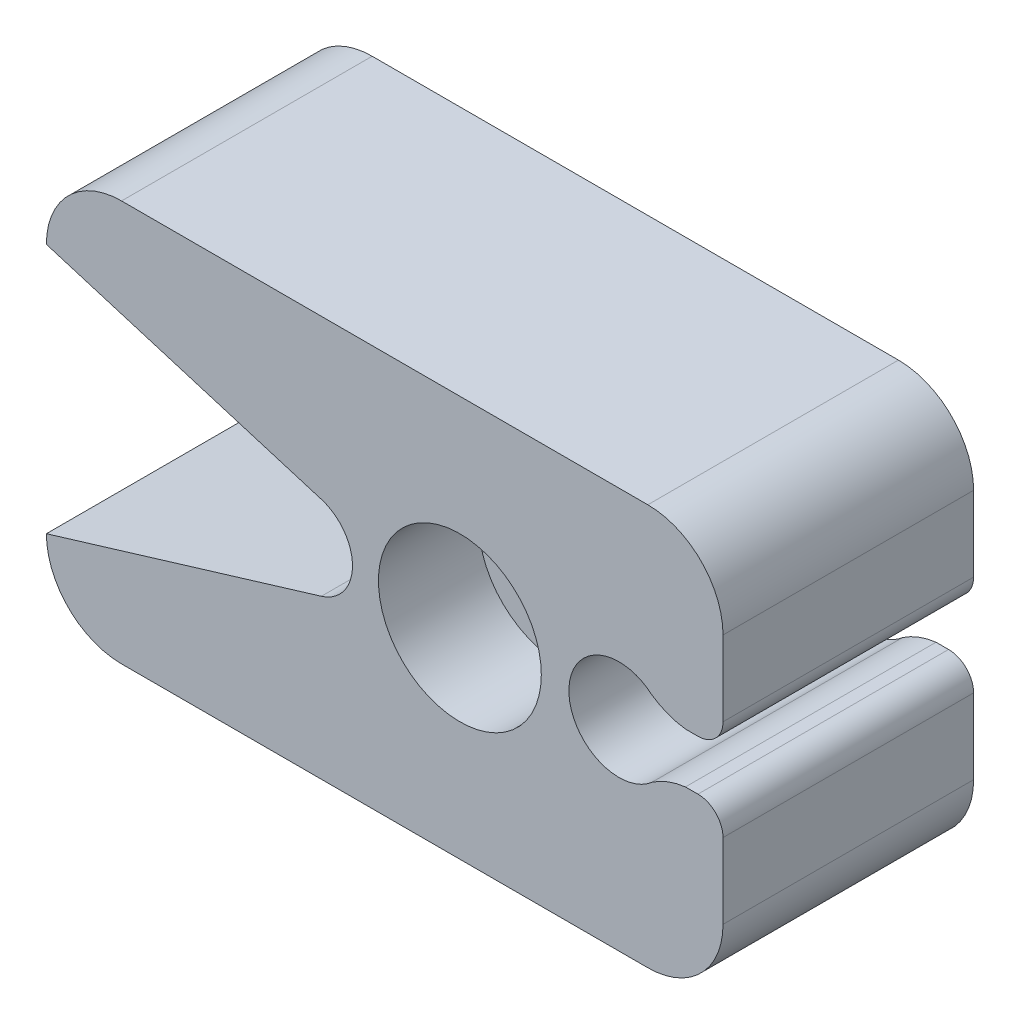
ISO-10303-21;
HEADER;
FILE_DESCRIPTION(('STEP AP214'),'2;1');
FILE_NAME('part.step','',(''),(''),'','','');
FILE_SCHEMA(('AUTOMOTIVE_DESIGN { 1 0 10303 214 1 1 1 1 }'));
ENDSEC;
DATA;
#1=APPLICATION_CONTEXT('core data for automotive mechanical design processes');
#2=APPLICATION_PROTOCOL_DEFINITION('international standard','automotive_design',2000,#1);
#3=PRODUCT_CONTEXT('',#1,'mechanical');
#4=PRODUCT('Part','Part','',(#3));
#5=PRODUCT_RELATED_PRODUCT_CATEGORY('part','',(#4));
#6=PRODUCT_DEFINITION_FORMATION('','',#4);
#7=PRODUCT_DEFINITION_CONTEXT('part definition',#1,'design');
#8=PRODUCT_DEFINITION('design','',#6,#7);
#9=PRODUCT_DEFINITION_SHAPE('','',#8);
#10=(LENGTH_UNIT() NAMED_UNIT(*) SI_UNIT(.MILLI.,.METRE.));
#11=(NAMED_UNIT(*) PLANE_ANGLE_UNIT() SI_UNIT($,.RADIAN.));
#12=(NAMED_UNIT(*) SI_UNIT($,.STERADIAN.) SOLID_ANGLE_UNIT());
#13=UNCERTAINTY_MEASURE_WITH_UNIT(LENGTH_MEASURE(1.E-05),#10,'distance_accuracy_value','');
#14=(GEOMETRIC_REPRESENTATION_CONTEXT(3) GLOBAL_UNCERTAINTY_ASSIGNED_CONTEXT((#13)) GLOBAL_UNIT_ASSIGNED_CONTEXT((#10,
#11,#12)) REPRESENTATION_CONTEXT('',''));
#15=CARTESIAN_POINT('',(0.,0.,0.));
#16=DIRECTION('',(0.,0.,1.));
#17=DIRECTION('',(1.,0.,0.));
#18=AXIS2_PLACEMENT_3D('',#15,#16,#17);
#19=CARTESIAN_POINT('',(21.,32.,20.));
#20=DIRECTION('',(-1.,0.,0.));
#21=DIRECTION('',(0.,-1.,0.));
#22=AXIS2_PLACEMENT_3D('',#19,#20,#21);
#23=PLANE('',#22);
#24=DIRECTION('',(0.,1.,0.));
#25=VECTOR('',#24,1.);
#26=CARTESIAN_POINT('',(21.,32.,20.));
#27=LINE('',#26,#25);
#28=CARTESIAN_POINT('',(21.,20.,20.));
#29=VERTEX_POINT('',#28);
#30=CARTESIAN_POINT('',(21.,26.,20.));
#31=VERTEX_POINT('',#30);
#32=EDGE_CURVE('E199',#29,#31,#27,.T.);
#33=ORIENTED_EDGE('',*,*,#32,.F.);
#34=DIRECTION('',(0.,0.,-1.));
#35=VECTOR('',#34,1.);
#36=CARTESIAN_POINT('',(21.,20.,0.));
#37=LINE('',#36,#35);
#38=CARTESIAN_POINT('',(21.,20.,0.));
#39=VERTEX_POINT('',#38);
#40=EDGE_CURVE('E24',#29,#39,#37,.T.);
#41=ORIENTED_EDGE('',*,*,#40,.T.);
#42=DIRECTION('',(0.,1.,0.));
#43=VECTOR('',#42,1.);
#44=CARTESIAN_POINT('',(21.,32.,0.));
#45=LINE('',#44,#43);
#46=CARTESIAN_POINT('',(21.,26.,0.));
#47=VERTEX_POINT('',#46);
#48=EDGE_CURVE('E194',#39,#47,#45,.T.);
#49=ORIENTED_EDGE('',*,*,#48,.T.);
#50=DIRECTION('',(0.,0.,-1.));
#51=VECTOR('',#50,1.);
#52=CARTESIAN_POINT('',(21.,26.,20.));
#53=LINE('',#52,#51);
#54=EDGE_CURVE('E232',#47,#31,#53,.F.);
#55=ORIENTED_EDGE('',*,*,#54,.T.);
#56=EDGE_LOOP('',(#33,#41,#49,#55));
#57=FACE_BOUND('',#56,.T.);
#58=ADVANCED_FACE('F16',(#57),#23,.F.);
#59=CARTESIAN_POINT('',(21.,6.,0.));
#60=VERTEX_POINT('',#59);
#61=CARTESIAN_POINT('',(21.,12.,0.));
#62=VERTEX_POINT('',#61);
#63=EDGE_CURVE('E207',#60,#62,#45,.T.);
#64=ORIENTED_EDGE('',*,*,#63,.T.);
#65=DIRECTION('',(0.,0.,-1.));
#66=VECTOR('',#65,1.);
#67=CARTESIAN_POINT('',(21.,12.,20.));
#68=LINE('',#67,#66);
#69=CARTESIAN_POINT('',(21.,12.,20.));
#70=VERTEX_POINT('',#69);
#71=EDGE_CURVE('E272',#62,#70,#68,.F.);
#72=ORIENTED_EDGE('',*,*,#71,.T.);
#73=CARTESIAN_POINT('',(21.,6.,20.));
#74=VERTEX_POINT('',#73);
#75=EDGE_CURVE('E201',#74,#70,#27,.T.);
#76=ORIENTED_EDGE('',*,*,#75,.F.);
#77=DIRECTION('',(0.,0.,-1.));
#78=VECTOR('',#77,1.);
#79=CARTESIAN_POINT('',(21.,6.,20.));
#80=LINE('',#79,#78);
#81=EDGE_CURVE('E229',#74,#60,#80,.T.);
#82=ORIENTED_EDGE('',*,*,#81,.T.);
#83=EDGE_LOOP('',(#64,#72,#76,#82));
#84=FACE_BOUND('',#83,.T.);
#85=ADVANCED_FACE('F326',(#84),#23,.F.);
#86=CARTESIAN_POINT('',(0.,0.,20.));
#87=DIRECTION('',(0.,0.,-1.));
#88=DIRECTION('',(-1.,0.,0.));
#89=AXIS2_PLACEMENT_3D('',#86,#87,#88);
#90=PLANE('',#89);
#91=CARTESIAN_POINT('',(0.,16.,20.));
#92=DIRECTION('',(0.,0.,1.));
#93=DIRECTION('',(1.,0.,0.));
#94=AXIS2_PLACEMENT_3D('',#91,#92,#93);
#95=CIRCLE('',#94,6.5);
#96=CARTESIAN_POINT('',(6.5,16.,20.));
#97=VERTEX_POINT('',#96);
#98=EDGE_CURVE('E343',#97,#97,#95,.T.);
#99=ORIENTED_EDGE('',*,*,#98,.F.);
#100=EDGE_LOOP('',(#99));
#101=FACE_BOUND('',#100,.T.);
#102=ORIENTED_EDGE('',*,*,#75,.T.);
#103=CARTESIAN_POINT('',(19.,12.,20.));
#104=DIRECTION('',(0.,0.,-1.));
#105=DIRECTION('',(-1.,0.,0.));
#106=AXIS2_PLACEMENT_3D('',#103,#104,#105);
#107=CIRCLE('',#106,2.);
#108=CARTESIAN_POINT('',(19.,14.,20.));
#109=VERTEX_POINT('',#108);
#110=EDGE_CURVE('E275',#70,#109,#107,.F.);
#111=ORIENTED_EDGE('',*,*,#110,.T.);
#112=DIRECTION('',(1.,0.,0.));
#113=VECTOR('',#112,1.);
#114=CARTESIAN_POINT('',(18.,14.,20.));
#115=LINE('',#114,#113);
#116=CARTESIAN_POINT('',(18.,14.,20.));
#117=VERTEX_POINT('',#116);
#118=EDGE_CURVE('E162',#117,#109,#115,.T.);
#119=ORIENTED_EDGE('',*,*,#118,.F.);
#120=CARTESIAN_POINT('',(18.7331691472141,8.04496322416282,20.));
#121=DIRECTION('',(0.,0.,-1.));
#122=DIRECTION('',(-1.,0.,0.));
#123=AXIS2_PLACEMENT_3D('',#120,#121,#122);
#124=CIRCLE('',#123,6.);
#125=CARTESIAN_POINT('',(15.3315337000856,12.9875208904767,20.));
#126=VERTEX_POINT('',#125);
#127=EDGE_CURVE('E172',#126,#117,#124,.T.);
#128=ORIENTED_EDGE('',*,*,#127,.F.);
#129=CARTESIAN_POINT('',(12.7,16.,20.));
#130=DIRECTION('',(0.,0.,1.));
#131=DIRECTION('',(1.,0.,0.));
#132=AXIS2_PLACEMENT_3D('',#129,#130,#131);
#133=CIRCLE('',#132,4.);
#134=CARTESIAN_POINT('',(15.3315337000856,19.0124791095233,20.));
#135=VERTEX_POINT('',#134);
#136=EDGE_CURVE('E154',#135,#126,#133,.T.);
#137=ORIENTED_EDGE('',*,*,#136,.F.);
#138=CARTESIAN_POINT('',(18.7331691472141,23.9550367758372,20.));
#139=DIRECTION('',(0.,0.,-1.));
#140=DIRECTION('',(1.,0.,0.));
#141=AXIS2_PLACEMENT_3D('',#138,#139,#140);
#142=CIRCLE('',#141,6.);
#143=CARTESIAN_POINT('',(18.,18.,20.));
#144=VERTEX_POINT('',#143);
#145=EDGE_CURVE('E144',#144,#135,#142,.T.);
#146=ORIENTED_EDGE('',*,*,#145,.F.);
#147=DIRECTION('',(-1.,0.,0.));
#148=VECTOR('',#147,1.);
#149=CARTESIAN_POINT('',(18.,18.,20.));
#150=LINE('',#149,#148);
#151=CARTESIAN_POINT('',(19.,18.,20.));
#152=VERTEX_POINT('',#151);
#153=EDGE_CURVE('E138',#152,#144,#150,.T.);
#154=ORIENTED_EDGE('',*,*,#153,.F.);
#155=CARTESIAN_POINT('',(19.,20.,20.));
#156=DIRECTION('',(0.,0.,-1.));
#157=DIRECTION('',(-1.,0.,0.));
#158=AXIS2_PLACEMENT_3D('',#155,#156,#157);
#159=CIRCLE('',#158,2.);
#160=EDGE_CURVE('E31',#152,#29,#159,.F.);
#161=ORIENTED_EDGE('',*,*,#160,.T.);
#162=ORIENTED_EDGE('',*,*,#32,.T.);
#163=CARTESIAN_POINT('',(15.,26.,20.));
#164=DIRECTION('',(0.,0.,-1.));
#165=DIRECTION('',(-1.,0.,0.));
#166=AXIS2_PLACEMENT_3D('',#163,#164,#165);
#167=CIRCLE('',#166,6.);
#168=CARTESIAN_POINT('',(15.,32.,20.));
#169=VERTEX_POINT('',#168);
#170=EDGE_CURVE('E242',#31,#169,#167,.F.);
#171=ORIENTED_EDGE('',*,*,#170,.T.);
#172=DIRECTION('',(-1.,0.,0.));
#173=VECTOR('',#172,1.);
#174=CARTESIAN_POINT('',(-33.,32.,20.));
#175=LINE('',#174,#173);
#176=CARTESIAN_POINT('',(-27.,32.,20.));
#177=VERTEX_POINT('',#176);
#178=EDGE_CURVE('E203',#169,#177,#175,.T.);
#179=ORIENTED_EDGE('',*,*,#178,.T.);
#180=CARTESIAN_POINT('',(-27.,26.,20.));
#181=DIRECTION('',(0.,0.,-1.));
#182=DIRECTION('',(-1.,0.,0.));
#183=AXIS2_PLACEMENT_3D('',#180,#181,#182);
#184=CIRCLE('',#183,6.);
#185=CARTESIAN_POINT('',(-33.,26.,20.));
#186=VERTEX_POINT('',#185);
#187=EDGE_CURVE('E235',#177,#186,#184,.F.);
#188=ORIENTED_EDGE('',*,*,#187,.T.);
#189=DIRECTION('',(-0.957024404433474,0.290007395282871,0.));
#190=VECTOR('',#189,1.);
#191=CARTESIAN_POINT('',(-33.,26.,20.));
#192=LINE('',#191,#190);
#193=CARTESIAN_POINT('',(-11.0536318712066,19.3495854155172,20.));
#194=VERTEX_POINT('',#193);
#195=EDGE_CURVE('E179',#194,#186,#192,.T.);
#196=ORIENTED_EDGE('',*,*,#195,.F.);
#197=CARTESIAN_POINT('',(-12.0686577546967,16.,20.));
#198=DIRECTION('',(0.,0.,1.));
#199=DIRECTION('',(1.,0.,0.));
#200=AXIS2_PLACEMENT_3D('',#197,#198,#199);
#201=CIRCLE('',#200,3.5);
#202=CARTESIAN_POINT('',(-11.0536318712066,12.6504145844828,20.));
#203=VERTEX_POINT('',#202);
#204=EDGE_CURVE('E188',#203,#194,#201,.T.);
#205=ORIENTED_EDGE('',*,*,#204,.F.);
#206=DIRECTION('',(0.957024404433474,0.290007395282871,0.));
#207=VECTOR('',#206,1.);
#208=CARTESIAN_POINT('',(-33.,6.,20.));
#209=LINE('',#208,#207);
#210=CARTESIAN_POINT('',(-33.,6.,20.));
#211=VERTEX_POINT('',#210);
#212=EDGE_CURVE('E143',#211,#203,#209,.T.);
#213=ORIENTED_EDGE('',*,*,#212,.F.);
#214=CARTESIAN_POINT('',(-27.,6.,20.));
#215=DIRECTION('',(0.,0.,-1.));
#216=DIRECTION('',(-1.,0.,0.));
#217=AXIS2_PLACEMENT_3D('',#214,#215,#216);
#218=CIRCLE('',#217,6.);
#219=CARTESIAN_POINT('',(-27.,0.,20.));
#220=VERTEX_POINT('',#219);
#221=EDGE_CURVE('E238',#211,#220,#218,.F.);
#222=ORIENTED_EDGE('',*,*,#221,.T.);
#223=DIRECTION('',(1.,0.,0.));
#224=VECTOR('',#223,1.);
#225=CARTESIAN_POINT('',(21.,0.,20.));
#226=LINE('',#225,#224);
#227=CARTESIAN_POINT('',(15.,0.,20.));
#228=VERTEX_POINT('',#227);
#229=EDGE_CURVE('E196',#220,#228,#226,.T.);
#230=ORIENTED_EDGE('',*,*,#229,.T.);
#231=CARTESIAN_POINT('',(15.,6.,20.));
#232=DIRECTION('',(0.,0.,-1.));
#233=DIRECTION('',(-1.,0.,0.));
#234=AXIS2_PLACEMENT_3D('',#231,#232,#233);
#235=CIRCLE('',#234,6.);
#236=EDGE_CURVE('E240',#228,#74,#235,.F.);
#237=ORIENTED_EDGE('',*,*,#236,.T.);
#238=EDGE_LOOP('',(#102,#111,#119,#128,#137,#146,#154,#161,#162,#171,#179,#188,#196,#205,#213,
#222,#230,#237));
#239=FACE_BOUND('',#238,.T.);
#240=ADVANCED_FACE('F157',(#101,#239),#90,.F.);
#241=CARTESIAN_POINT('',(0.,0.,0.));
#242=DIRECTION('',(0.,0.,-1.));
#243=DIRECTION('',(-1.,0.,0.));
#244=AXIS2_PLACEMENT_3D('',#241,#242,#243);
#245=PLANE('',#244);
#246=CARTESIAN_POINT('',(0.,16.,0.));
#247=DIRECTION('',(0.,0.,1.));
#248=DIRECTION('',(1.,0.,0.));
#249=AXIS2_PLACEMENT_3D('',#246,#247,#248);
#250=CIRCLE('',#249,4.);
#251=CARTESIAN_POINT('',(4.,16.,0.));
#252=VERTEX_POINT('',#251);
#253=EDGE_CURVE('E346',#252,#252,#250,.T.);
#254=ORIENTED_EDGE('',*,*,#253,.T.);
#255=EDGE_LOOP('',(#254));
#256=FACE_BOUND('',#255,.T.);
#257=DIRECTION('',(1.,0.,0.));
#258=VECTOR('',#257,1.);
#259=CARTESIAN_POINT('',(0.,14.,0.));
#260=LINE('',#259,#258);
#261=CARTESIAN_POINT('',(18.,14.,0.));
#262=VERTEX_POINT('',#261);
#263=CARTESIAN_POINT('',(19.,14.,0.));
#264=VERTEX_POINT('',#263);
#265=EDGE_CURVE('E253',#262,#264,#260,.T.);
#266=ORIENTED_EDGE('',*,*,#265,.T.);
#267=CARTESIAN_POINT('',(19.,12.,0.));
#268=DIRECTION('',(0.,0.,-1.));
#269=DIRECTION('',(-1.,0.,0.));
#270=AXIS2_PLACEMENT_3D('',#267,#268,#269);
#271=CIRCLE('',#270,2.);
#272=EDGE_CURVE('E270',#264,#62,#271,.T.);
#273=ORIENTED_EDGE('',*,*,#272,.T.);
#274=ORIENTED_EDGE('',*,*,#63,.F.);
#275=CARTESIAN_POINT('',(15.,6.,0.));
#276=DIRECTION('',(0.,0.,-1.));
#277=DIRECTION('',(-1.,0.,0.));
#278=AXIS2_PLACEMENT_3D('',#275,#276,#277);
#279=CIRCLE('',#278,6.);
#280=CARTESIAN_POINT('',(15.,0.,0.));
#281=VERTEX_POINT('',#280);
#282=EDGE_CURVE('E224',#60,#281,#279,.T.);
#283=ORIENTED_EDGE('',*,*,#282,.T.);
#284=DIRECTION('',(1.,0.,0.));
#285=VECTOR('',#284,1.);
#286=CARTESIAN_POINT('',(0.,0.,0.));
#287=LINE('',#286,#285);
#288=CARTESIAN_POINT('',(-27.,0.,0.));
#289=VERTEX_POINT('',#288);
#290=EDGE_CURVE('E200',#289,#281,#287,.T.);
#291=ORIENTED_EDGE('',*,*,#290,.F.);
#292=CARTESIAN_POINT('',(-27.,6.,0.));
#293=DIRECTION('',(0.,0.,-1.));
#294=DIRECTION('',(-1.,0.,0.));
#295=AXIS2_PLACEMENT_3D('',#292,#293,#294);
#296=CIRCLE('',#295,6.);
#297=CARTESIAN_POINT('',(-33.,6.,0.));
#298=VERTEX_POINT('',#297);
#299=EDGE_CURVE('E221',#289,#298,#296,.T.);
#300=ORIENTED_EDGE('',*,*,#299,.T.);
#301=DIRECTION('',(0.957024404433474,0.290007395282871,0.));
#302=VECTOR('',#301,1.);
#303=CARTESIAN_POINT('',(-33.,6.,0.));
#304=LINE('',#303,#302);
#305=CARTESIAN_POINT('',(-11.0536318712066,12.6504145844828,0.));
#306=VERTEX_POINT('',#305);
#307=EDGE_CURVE('E175',#298,#306,#304,.T.);
#308=ORIENTED_EDGE('',*,*,#307,.T.);
#309=CARTESIAN_POINT('',(-12.0686577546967,16.,0.));
#310=DIRECTION('',(0.,0.,1.));
#311=DIRECTION('',(1.,0.,0.));
#312=AXIS2_PLACEMENT_3D('',#309,#310,#311);
#313=CIRCLE('',#312,3.5);
#314=CARTESIAN_POINT('',(-11.0536318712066,19.3495854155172,0.));
#315=VERTEX_POINT('',#314);
#316=EDGE_CURVE('E178',#306,#315,#313,.T.);
#317=ORIENTED_EDGE('',*,*,#316,.T.);
#318=DIRECTION('',(-0.957024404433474,0.290007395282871,0.));
#319=VECTOR('',#318,1.);
#320=CARTESIAN_POINT('',(-33.,26.,0.));
#321=LINE('',#320,#319);
#322=CARTESIAN_POINT('',(-33.,26.,0.));
#323=VERTEX_POINT('',#322);
#324=EDGE_CURVE('E182',#315,#323,#321,.T.);
#325=ORIENTED_EDGE('',*,*,#324,.T.);
#326=CARTESIAN_POINT('',(-27.,26.,0.));
#327=DIRECTION('',(0.,0.,-1.));
#328=DIRECTION('',(-1.,0.,0.));
#329=AXIS2_PLACEMENT_3D('',#326,#327,#328);
#330=CIRCLE('',#329,6.);
#331=CARTESIAN_POINT('',(-27.,32.,0.));
#332=VERTEX_POINT('',#331);
#333=EDGE_CURVE('E219',#323,#332,#330,.T.);
#334=ORIENTED_EDGE('',*,*,#333,.T.);
#335=DIRECTION('',(-1.,0.,0.));
#336=VECTOR('',#335,1.);
#337=CARTESIAN_POINT('',(-33.,32.,0.));
#338=LINE('',#337,#336);
#339=CARTESIAN_POINT('',(15.,32.,0.));
#340=VERTEX_POINT('',#339);
#341=EDGE_CURVE('E210',#340,#332,#338,.T.);
#342=ORIENTED_EDGE('',*,*,#341,.F.);
#343=CARTESIAN_POINT('',(15.,26.,0.));
#344=DIRECTION('',(0.,0.,-1.));
#345=DIRECTION('',(-1.,0.,0.));
#346=AXIS2_PLACEMENT_3D('',#343,#344,#345);
#347=CIRCLE('',#346,6.);
#348=EDGE_CURVE('E226',#340,#47,#347,.T.);
#349=ORIENTED_EDGE('',*,*,#348,.T.);
#350=ORIENTED_EDGE('',*,*,#48,.F.);
#351=CARTESIAN_POINT('',(19.,20.,0.));
#352=DIRECTION('',(0.,0.,-1.));
#353=DIRECTION('',(-1.,0.,0.));
#354=AXIS2_PLACEMENT_3D('',#351,#352,#353);
#355=CIRCLE('',#354,2.);
#356=CARTESIAN_POINT('',(19.,18.,0.));
#357=VERTEX_POINT('',#356);
#358=EDGE_CURVE('E268',#39,#357,#355,.T.);
#359=ORIENTED_EDGE('',*,*,#358,.T.);
#360=DIRECTION('',(-1.,0.,0.));
#361=VECTOR('',#360,1.);
#362=CARTESIAN_POINT('',(0.,18.,0.));
#363=LINE('',#362,#361);
#364=CARTESIAN_POINT('',(18.,18.,0.));
#365=VERTEX_POINT('',#364);
#366=EDGE_CURVE('E263',#357,#365,#363,.T.);
#367=ORIENTED_EDGE('',*,*,#366,.T.);
#368=CARTESIAN_POINT('',(18.7331691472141,23.9550367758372,0.));
#369=DIRECTION('',(0.,0.,-1.));
#370=DIRECTION('',(-1.,0.,0.));
#371=AXIS2_PLACEMENT_3D('',#368,#369,#370);
#372=CIRCLE('',#371,6.);
#373=CARTESIAN_POINT('',(15.3315337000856,19.0124791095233,0.));
#374=VERTEX_POINT('',#373);
#375=EDGE_CURVE('E153',#365,#374,#372,.T.);
#376=ORIENTED_EDGE('',*,*,#375,.T.);
#377=CARTESIAN_POINT('',(12.7,16.,0.));
#378=DIRECTION('',(0.,0.,-1.));
#379=DIRECTION('',(-1.,0.,0.));
#380=AXIS2_PLACEMENT_3D('',#377,#378,#379);
#381=CIRCLE('',#380,4.);
#382=CARTESIAN_POINT('',(15.3315337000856,12.9875208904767,0.));
#383=VERTEX_POINT('',#382);
#384=EDGE_CURVE('E259',#374,#383,#381,.F.);
#385=ORIENTED_EDGE('',*,*,#384,.T.);
#386=CARTESIAN_POINT('',(18.7331691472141,8.04496322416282,0.));
#387=DIRECTION('',(0.,0.,-1.));
#388=DIRECTION('',(-1.,0.,0.));
#389=AXIS2_PLACEMENT_3D('',#386,#387,#388);
#390=CIRCLE('',#389,6.);
#391=EDGE_CURVE('E256',#383,#262,#390,.T.);
#392=ORIENTED_EDGE('',*,*,#391,.T.);
#393=EDGE_LOOP('',(#266,#273,#274,#283,#291,#300,#308,#317,#325,#334,#342,#349,#350,#359,#367,
#376,#385,#392));
#394=FACE_BOUND('',#393,.T.);
#395=ADVANCED_FACE('F282',(#256,#394),#245,.T.);
#396=CARTESIAN_POINT('',(-33.,32.,20.));
#397=DIRECTION('',(0.,-1.,0.));
#398=DIRECTION('',(0.,0.,-1.));
#399=AXIS2_PLACEMENT_3D('',#396,#397,#398);
#400=PLANE('',#399);
#401=ORIENTED_EDGE('',*,*,#178,.F.);
#402=DIRECTION('',(0.,0.,-1.));
#403=VECTOR('',#402,1.);
#404=CARTESIAN_POINT('',(15.,32.,20.));
#405=LINE('',#404,#403);
#406=EDGE_CURVE('E216',#169,#340,#405,.T.);
#407=ORIENTED_EDGE('',*,*,#406,.T.);
#408=ORIENTED_EDGE('',*,*,#341,.T.);
#409=DIRECTION('',(0.,0.,-1.));
#410=VECTOR('',#409,1.);
#411=CARTESIAN_POINT('',(-27.,32.,20.));
#412=LINE('',#411,#410);
#413=EDGE_CURVE('E206',#332,#177,#412,.F.);
#414=ORIENTED_EDGE('',*,*,#413,.T.);
#415=EDGE_LOOP('',(#401,#407,#408,#414));
#416=FACE_BOUND('',#415,.T.);
#417=ADVANCED_FACE('F292',(#416),#400,.F.);
#418=CARTESIAN_POINT('',(0.,0.,20.));
#419=DIRECTION('',(0.,1.,0.));
#420=DIRECTION('',(-1.,0.,0.));
#421=AXIS2_PLACEMENT_3D('',#418,#419,#420);
#422=PLANE('',#421);
#423=ORIENTED_EDGE('',*,*,#290,.T.);
#424=DIRECTION('',(0.,0.,-1.));
#425=VECTOR('',#424,1.);
#426=CARTESIAN_POINT('',(15.,0.,20.));
#427=LINE('',#426,#425);
#428=EDGE_CURVE('E247',#281,#228,#427,.F.);
#429=ORIENTED_EDGE('',*,*,#428,.T.);
#430=ORIENTED_EDGE('',*,*,#229,.F.);
#431=DIRECTION('',(0.,0.,-1.));
#432=VECTOR('',#431,1.);
#433=CARTESIAN_POINT('',(-27.,0.,20.));
#434=LINE('',#433,#432);
#435=EDGE_CURVE('E244',#220,#289,#434,.T.);
#436=ORIENTED_EDGE('',*,*,#435,.T.);
#437=EDGE_LOOP('',(#423,#429,#430,#436));
#438=FACE_BOUND('',#437,.T.);
#439=ADVANCED_FACE('F317',(#438),#422,.F.);
#440=CARTESIAN_POINT('',(15.,26.,20.));
#441=DIRECTION('',(0.,0.,-1.));
#442=DIRECTION('',(-1.,0.,0.));
#443=AXIS2_PLACEMENT_3D('',#440,#441,#442);
#444=CYLINDRICAL_SURFACE('',#443,6.);
#445=ORIENTED_EDGE('',*,*,#170,.F.);
#446=ORIENTED_EDGE('',*,*,#54,.F.);
#447=ORIENTED_EDGE('',*,*,#348,.F.);
#448=ORIENTED_EDGE('',*,*,#406,.F.);
#449=EDGE_LOOP('',(#445,#446,#447,#448));
#450=FACE_BOUND('',#449,.T.);
#451=ADVANCED_FACE('F288',(#450),#444,.T.);
#452=CARTESIAN_POINT('',(15.,6.,20.));
#453=DIRECTION('',(0.,0.,-1.));
#454=DIRECTION('',(-1.,0.,0.));
#455=AXIS2_PLACEMENT_3D('',#452,#453,#454);
#456=CYLINDRICAL_SURFACE('',#455,6.);
#457=ORIENTED_EDGE('',*,*,#236,.F.);
#458=ORIENTED_EDGE('',*,*,#428,.F.);
#459=ORIENTED_EDGE('',*,*,#282,.F.);
#460=ORIENTED_EDGE('',*,*,#81,.F.);
#461=EDGE_LOOP('',(#457,#458,#459,#460));
#462=FACE_BOUND('',#461,.T.);
#463=ADVANCED_FACE('F323',(#462),#456,.T.);
#464=CARTESIAN_POINT('',(-27.,6.,20.));
#465=DIRECTION('',(0.,0.,-1.));
#466=DIRECTION('',(-1.,0.,0.));
#467=AXIS2_PLACEMENT_3D('',#464,#465,#466);
#468=CYLINDRICAL_SURFACE('',#467,6.);
#469=ORIENTED_EDGE('',*,*,#221,.F.);
#470=DIRECTION('',(0.,0.,-1.));
#471=VECTOR('',#470,1.);
#472=CARTESIAN_POINT('',(-33.,6.,20.));
#473=LINE('',#472,#471);
#474=EDGE_CURVE('E251',#298,#211,#473,.F.);
#475=ORIENTED_EDGE('',*,*,#474,.F.);
#476=ORIENTED_EDGE('',*,*,#299,.F.);
#477=ORIENTED_EDGE('',*,*,#435,.F.);
#478=EDGE_LOOP('',(#469,#475,#476,#477));
#479=FACE_BOUND('',#478,.T.);
#480=ADVANCED_FACE('F314',(#479),#468,.T.);
#481=CARTESIAN_POINT('',(-27.,26.,20.));
#482=DIRECTION('',(0.,0.,-1.));
#483=DIRECTION('',(-1.,0.,0.));
#484=AXIS2_PLACEMENT_3D('',#481,#482,#483);
#485=CYLINDRICAL_SURFACE('',#484,6.);
#486=ORIENTED_EDGE('',*,*,#187,.F.);
#487=ORIENTED_EDGE('',*,*,#413,.F.);
#488=ORIENTED_EDGE('',*,*,#333,.F.);
#489=DIRECTION('',(0.,0.,-1.));
#490=VECTOR('',#489,1.);
#491=CARTESIAN_POINT('',(-33.,26.,20.));
#492=LINE('',#491,#490);
#493=EDGE_CURVE('E249',#186,#323,#492,.T.);
#494=ORIENTED_EDGE('',*,*,#493,.F.);
#495=EDGE_LOOP('',(#486,#487,#488,#494));
#496=FACE_BOUND('',#495,.T.);
#497=ADVANCED_FACE('F296',(#496),#485,.T.);
#498=CARTESIAN_POINT('',(-33.,26.,0.));
#499=DIRECTION('',(0.290007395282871,0.957024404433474,0.));
#500=DIRECTION('',(-0.957024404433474,0.290007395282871,0.));
#501=AXIS2_PLACEMENT_3D('',#498,#499,#500);
#502=PLANE('',#501);
#503=ORIENTED_EDGE('',*,*,#195,.T.);
#504=ORIENTED_EDGE('',*,*,#493,.T.);
#505=ORIENTED_EDGE('',*,*,#324,.F.);
#506=DIRECTION('',(0.,0.,1.));
#507=VECTOR('',#506,1.);
#508=CARTESIAN_POINT('',(-11.0536318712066,19.3495854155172,0.));
#509=LINE('',#508,#507);
#510=EDGE_CURVE('E192',#315,#194,#509,.T.);
#511=ORIENTED_EDGE('',*,*,#510,.T.);
#512=EDGE_LOOP('',(#503,#504,#505,#511));
#513=FACE_BOUND('',#512,.T.);
#514=ADVANCED_FACE('F302',(#513),#502,.F.);
#515=CARTESIAN_POINT('',(-12.0686577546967,16.,0.));
#516=DIRECTION('',(0.,0.,1.));
#517=DIRECTION('',(1.,0.,0.));
#518=AXIS2_PLACEMENT_3D('',#515,#516,#517);
#519=CYLINDRICAL_SURFACE('',#518,3.5);
#520=ORIENTED_EDGE('',*,*,#204,.T.);
#521=ORIENTED_EDGE('',*,*,#510,.F.);
#522=ORIENTED_EDGE('',*,*,#316,.F.);
#523=DIRECTION('',(0.,0.,1.));
#524=VECTOR('',#523,1.);
#525=CARTESIAN_POINT('',(-11.0536318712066,12.6504145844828,0.));
#526=LINE('',#525,#524);
#527=EDGE_CURVE('E185',#306,#203,#526,.T.);
#528=ORIENTED_EDGE('',*,*,#527,.T.);
#529=EDGE_LOOP('',(#520,#521,#522,#528));
#530=FACE_BOUND('',#529,.T.);
#531=ADVANCED_FACE('F306',(#530),#519,.F.);
#532=CARTESIAN_POINT('',(-33.,6.,0.));
#533=DIRECTION('',(0.290007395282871,-0.957024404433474,0.));
#534=DIRECTION('',(0.957024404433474,0.290007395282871,0.));
#535=AXIS2_PLACEMENT_3D('',#532,#533,#534);
#536=PLANE('',#535);
#537=ORIENTED_EDGE('',*,*,#212,.T.);
#538=ORIENTED_EDGE('',*,*,#527,.F.);
#539=ORIENTED_EDGE('',*,*,#307,.F.);
#540=ORIENTED_EDGE('',*,*,#474,.T.);
#541=EDGE_LOOP('',(#537,#538,#539,#540));
#542=FACE_BOUND('',#541,.T.);
#543=ADVANCED_FACE('F308',(#542),#536,.F.);
#544=CARTESIAN_POINT('',(18.,18.,20.));
#545=DIRECTION('',(0.,-1.,0.));
#546=DIRECTION('',(0.,0.,-1.));
#547=AXIS2_PLACEMENT_3D('',#544,#545,#546);
#548=PLANE('',#547);
#549=ORIENTED_EDGE('',*,*,#366,.F.);
#550=DIRECTION('',(0.,0.,-1.));
#551=VECTOR('',#550,1.);
#552=CARTESIAN_POINT('',(19.,18.,20.));
#553=LINE('',#552,#551);
#554=EDGE_CURVE('E10',#357,#152,#553,.F.);
#555=ORIENTED_EDGE('',*,*,#554,.T.);
#556=ORIENTED_EDGE('',*,*,#153,.T.);
#557=DIRECTION('',(0.,0.,-1.));
#558=VECTOR('',#557,1.);
#559=CARTESIAN_POINT('',(18.,18.,20.));
#560=LINE('',#559,#558);
#561=EDGE_CURVE('E141',#144,#365,#560,.T.);
#562=ORIENTED_EDGE('',*,*,#561,.T.);
#563=EDGE_LOOP('',(#549,#555,#556,#562));
#564=FACE_BOUND('',#563,.T.);
#565=ADVANCED_FACE('F140',(#564),#548,.T.);
#566=CARTESIAN_POINT('',(18.7331691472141,23.9550367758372,20.));
#567=DIRECTION('',(0.,0.,-1.));
#568=DIRECTION('',(-1.,0.,0.));
#569=AXIS2_PLACEMENT_3D('',#566,#567,#568);
#570=CYLINDRICAL_SURFACE('',#569,6.);
#571=ORIENTED_EDGE('',*,*,#375,.F.);
#572=ORIENTED_EDGE('',*,*,#561,.F.);
#573=ORIENTED_EDGE('',*,*,#145,.T.);
#574=DIRECTION('',(0.,0.,-1.));
#575=VECTOR('',#574,1.);
#576=CARTESIAN_POINT('',(15.3315337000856,19.0124791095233,20.));
#577=LINE('',#576,#575);
#578=EDGE_CURVE('E173',#135,#374,#577,.T.);
#579=ORIENTED_EDGE('',*,*,#578,.T.);
#580=EDGE_LOOP('',(#571,#572,#573,#579));
#581=FACE_BOUND('',#580,.T.);
#582=ADVANCED_FACE('F149',(#581),#570,.T.);
#583=CARTESIAN_POINT('',(12.7,16.,20.));
#584=DIRECTION('',(0.,0.,-1.));
#585=DIRECTION('',(-1.,0.,0.));
#586=AXIS2_PLACEMENT_3D('',#583,#584,#585);
#587=CYLINDRICAL_SURFACE('',#586,4.);
#588=ORIENTED_EDGE('',*,*,#384,.F.);
#589=ORIENTED_EDGE('',*,*,#578,.F.);
#590=ORIENTED_EDGE('',*,*,#136,.T.);
#591=DIRECTION('',(0.,0.,-1.));
#592=VECTOR('',#591,1.);
#593=CARTESIAN_POINT('',(15.3315337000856,12.9875208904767,20.));
#594=LINE('',#593,#592);
#595=EDGE_CURVE('E169',#126,#383,#594,.T.);
#596=ORIENTED_EDGE('',*,*,#595,.T.);
#597=EDGE_LOOP('',(#588,#589,#590,#596));
#598=FACE_BOUND('',#597,.T.);
#599=ADVANCED_FACE('F340',(#598),#587,.F.);
#600=CARTESIAN_POINT('',(18.7331691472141,8.04496322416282,20.));
#601=DIRECTION('',(0.,0.,-1.));
#602=DIRECTION('',(-1.,0.,0.));
#603=AXIS2_PLACEMENT_3D('',#600,#601,#602);
#604=CYLINDRICAL_SURFACE('',#603,6.);
#605=ORIENTED_EDGE('',*,*,#391,.F.);
#606=ORIENTED_EDGE('',*,*,#595,.F.);
#607=ORIENTED_EDGE('',*,*,#127,.T.);
#608=DIRECTION('',(0.,0.,-1.));
#609=VECTOR('',#608,1.);
#610=CARTESIAN_POINT('',(18.,14.,20.));
#611=LINE('',#610,#609);
#612=EDGE_CURVE('E165',#117,#262,#611,.T.);
#613=ORIENTED_EDGE('',*,*,#612,.T.);
#614=EDGE_LOOP('',(#605,#606,#607,#613));
#615=FACE_BOUND('',#614,.T.);
#616=ADVANCED_FACE('F337',(#615),#604,.T.);
#617=CARTESIAN_POINT('',(18.,14.,20.));
#618=DIRECTION('',(0.,1.,0.));
#619=DIRECTION('',(0.,0.,1.));
#620=AXIS2_PLACEMENT_3D('',#617,#618,#619);
#621=PLANE('',#620);
#622=ORIENTED_EDGE('',*,*,#118,.T.);
#623=DIRECTION('',(0.,0.,-1.));
#624=VECTOR('',#623,1.);
#625=CARTESIAN_POINT('',(19.,14.,0.));
#626=LINE('',#625,#624);
#627=EDGE_CURVE('E265',#109,#264,#626,.T.);
#628=ORIENTED_EDGE('',*,*,#627,.T.);
#629=ORIENTED_EDGE('',*,*,#265,.F.);
#630=ORIENTED_EDGE('',*,*,#612,.F.);
#631=EDGE_LOOP('',(#622,#628,#629,#630));
#632=FACE_BOUND('',#631,.T.);
#633=ADVANCED_FACE('F335',(#632),#621,.T.);
#634=CARTESIAN_POINT('',(19.,12.,20.));
#635=DIRECTION('',(0.,0.,1.));
#636=DIRECTION('',(1.,0.,0.));
#637=AXIS2_PLACEMENT_3D('',#634,#635,#636);
#638=CYLINDRICAL_SURFACE('',#637,2.);
#639=ORIENTED_EDGE('',*,*,#110,.F.);
#640=ORIENTED_EDGE('',*,*,#71,.F.);
#641=ORIENTED_EDGE('',*,*,#272,.F.);
#642=ORIENTED_EDGE('',*,*,#627,.F.);
#643=EDGE_LOOP('',(#639,#640,#641,#642));
#644=FACE_BOUND('',#643,.T.);
#645=ADVANCED_FACE('F333',(#644),#638,.T.);
#646=CARTESIAN_POINT('',(19.,20.,20.));
#647=DIRECTION('',(0.,0.,1.));
#648=DIRECTION('',(1.,0.,0.));
#649=AXIS2_PLACEMENT_3D('',#646,#647,#648);
#650=CYLINDRICAL_SURFACE('',#649,2.);
#651=ORIENTED_EDGE('',*,*,#160,.F.);
#652=ORIENTED_EDGE('',*,*,#554,.F.);
#653=ORIENTED_EDGE('',*,*,#358,.F.);
#654=ORIENTED_EDGE('',*,*,#40,.F.);
#655=EDGE_LOOP('',(#651,#652,#653,#654));
#656=FACE_BOUND('',#655,.T.);
#657=ADVANCED_FACE('F18',(#656),#650,.T.);
#658=CARTESIAN_POINT('',(0.,16.,12.));
#659=DIRECTION('',(0.,0.,1.));
#660=DIRECTION('',(1.,0.,0.));
#661=AXIS2_PLACEMENT_3D('',#658,#659,#660);
#662=CYLINDRICAL_SURFACE('',#661,6.5);
#663=CARTESIAN_POINT('',(0.,16.,12.));
#664=DIRECTION('',(0.,0.,1.));
#665=DIRECTION('',(1.,0.,0.));
#666=AXIS2_PLACEMENT_3D('',#663,#664,#665);
#667=CIRCLE('',#666,6.5);
#668=CARTESIAN_POINT('',(6.5,16.,12.));
#669=VERTEX_POINT('',#668);
#670=EDGE_CURVE('E168',#669,#669,#667,.T.);
#671=ORIENTED_EDGE('',*,*,#670,.F.);
#672=EDGE_LOOP('',(#671));
#673=FACE_BOUND('',#672,.T.);
#674=ORIENTED_EDGE('',*,*,#98,.T.);
#675=EDGE_LOOP('',(#674));
#676=FACE_BOUND('',#675,.T.);
#677=ADVANCED_FACE('F365',(#673,#676),#662,.F.);
#678=CARTESIAN_POINT('',(0.,16.,12.));
#679=DIRECTION('',(0.,0.,1.));
#680=DIRECTION('',(1.,0.,0.));
#681=AXIS2_PLACEMENT_3D('',#678,#679,#680);
#682=PLANE('',#681);
#683=CARTESIAN_POINT('',(0.,16.,12.));
#684=DIRECTION('',(0.,0.,1.));
#685=DIRECTION('',(1.,0.,0.));
#686=AXIS2_PLACEMENT_3D('',#683,#684,#685);
#687=CIRCLE('',#686,4.);
#688=CARTESIAN_POINT('',(4.,16.,12.));
#689=VERTEX_POINT('',#688);
#690=EDGE_CURVE('E349',#689,#689,#687,.T.);
#691=ORIENTED_EDGE('',*,*,#690,.F.);
#692=EDGE_LOOP('',(#691));
#693=FACE_BOUND('',#692,.T.);
#694=ORIENTED_EDGE('',*,*,#670,.T.);
#695=EDGE_LOOP('',(#694));
#696=FACE_BOUND('',#695,.T.);
#697=ADVANCED_FACE('F359',(#693,#696),#682,.T.);
#698=CARTESIAN_POINT('',(0.,16.,0.));
#699=DIRECTION('',(0.,0.,1.));
#700=DIRECTION('',(1.,0.,0.));
#701=AXIS2_PLACEMENT_3D('',#698,#699,#700);
#702=CYLINDRICAL_SURFACE('',#701,4.);
#703=ORIENTED_EDGE('',*,*,#253,.F.);
#704=EDGE_LOOP('',(#703));
#705=FACE_BOUND('',#704,.T.);
#706=ORIENTED_EDGE('',*,*,#690,.T.);
#707=EDGE_LOOP('',(#706));
#708=FACE_BOUND('',#707,.T.);
#709=ADVANCED_FACE('F356',(#705,#708),#702,.F.);
#710=CLOSED_SHELL('',(#58,#85,#240,#395,#417,#439,#451,#463,#480,#497,#514,#531,#543,#565,#582,
#599,#616,#633,#645,#657,#677,#697,#709));
#711=MANIFOLD_SOLID_BREP('B1',#710);
#712=ADVANCED_BREP_SHAPE_REPRESENTATION('',(#18,#711),#14);
#713=SHAPE_DEFINITION_REPRESENTATION(#9,#712);
ENDSEC;
END-ISO-10303-21;
